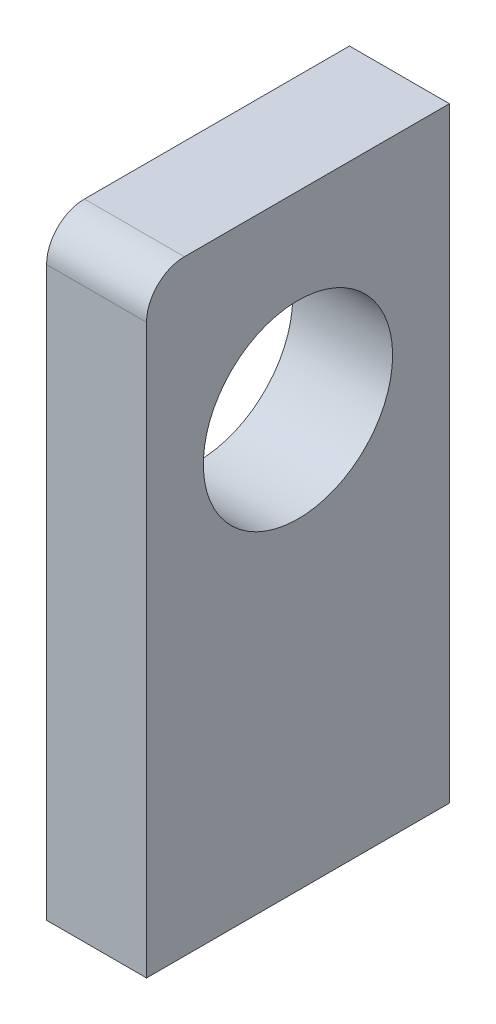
from build123d import *

# Parameters (mm, degrees)
SKETCH1_W           = 40
SKETCH1_H           = 80
SKETCH1_R           = 12.5
BOSS_EXTRUDE1_DEPTH = 13.2
FILLET2_R           = 5


with BuildPart() as part:
    # Sketch1 → Boss-Extrude1 (new body)
    with BuildSketch(Plane(origin=(0, 0, 0), x_dir=(0, 0, -1), z_dir=(1, 0, 0))):
        with Locations((20, -40)):
            Rectangle(SKETCH1_W, SKETCH1_H)
        with Locations((20, -25)):
            Circle(SKETCH1_R, mode=Mode.SUBTRACT)
    extrude(amount=BOSS_EXTRUDE1_DEPTH)

    # Fillet2
    fillet2_edges = [part.edges().sort_by_distance(p)[0] for p in [
        (6.6, 0, 0),
    ]]
    fillet(fillet2_edges, radius=FILLET2_R)


solid = part.part
